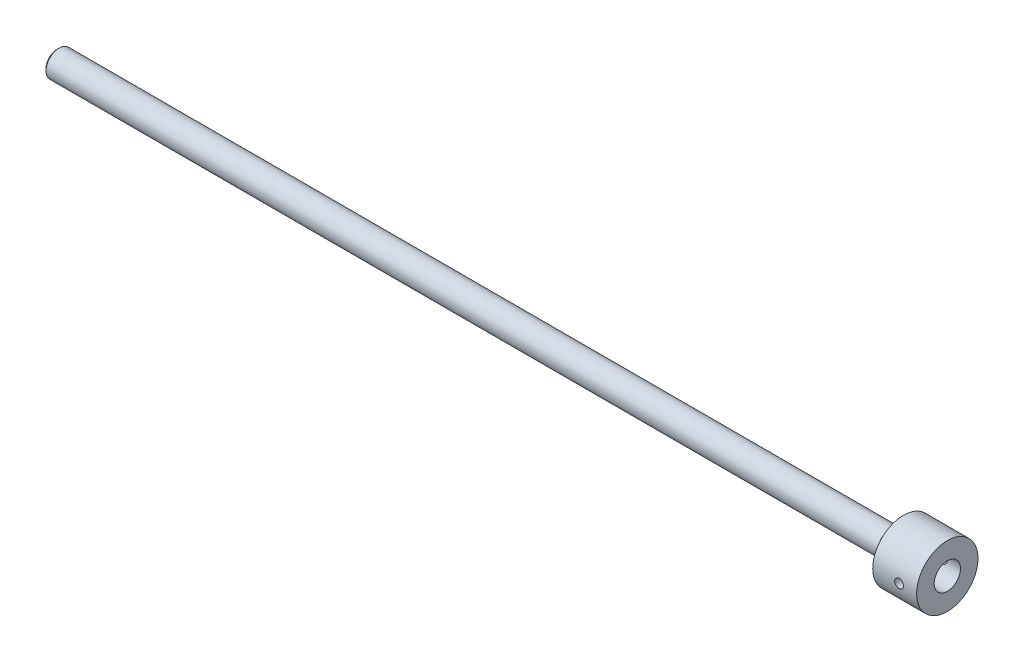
ISO-10303-21;
HEADER;
FILE_DESCRIPTION(('STEP AP214'),'2;1');
FILE_NAME('part.step','',(''),(''),'','','');
FILE_SCHEMA(('AUTOMOTIVE_DESIGN { 1 0 10303 214 1 1 1 1 }'));
ENDSEC;
DATA;
#1=APPLICATION_CONTEXT('core data for automotive mechanical design processes');
#2=APPLICATION_PROTOCOL_DEFINITION('international standard','automotive_design',2000,#1);
#3=PRODUCT_CONTEXT('',#1,'mechanical');
#4=PRODUCT('Part','Part','',(#3));
#5=PRODUCT_RELATED_PRODUCT_CATEGORY('part','',(#4));
#6=PRODUCT_DEFINITION_FORMATION('','',#4);
#7=PRODUCT_DEFINITION_CONTEXT('part definition',#1,'design');
#8=PRODUCT_DEFINITION('design','',#6,#7);
#9=PRODUCT_DEFINITION_SHAPE('','',#8);
#10=(LENGTH_UNIT() NAMED_UNIT(*) SI_UNIT(.MILLI.,.METRE.));
#11=(NAMED_UNIT(*) PLANE_ANGLE_UNIT() SI_UNIT($,.RADIAN.));
#12=(NAMED_UNIT(*) SI_UNIT($,.STERADIAN.) SOLID_ANGLE_UNIT());
#13=UNCERTAINTY_MEASURE_WITH_UNIT(LENGTH_MEASURE(1.E-05),#10,'distance_accuracy_value','');
#14=(GEOMETRIC_REPRESENTATION_CONTEXT(3) GLOBAL_UNCERTAINTY_ASSIGNED_CONTEXT((#13)) GLOBAL_UNIT_ASSIGNED_CONTEXT((#10,
#11,#12)) REPRESENTATION_CONTEXT('',''));
#15=CARTESIAN_POINT('',(0.,0.,0.));
#16=DIRECTION('',(0.,0.,1.));
#17=DIRECTION('',(1.,0.,0.));
#18=AXIS2_PLACEMENT_3D('',#15,#16,#17);
#19=CARTESIAN_POINT('',(0.,0.,0.));
#20=DIRECTION('',(-1.,0.,0.));
#21=DIRECTION('',(0.,0.,1.));
#22=AXIS2_PLACEMENT_3D('',#19,#20,#21);
#23=PLANE('',#22);
#24=CARTESIAN_POINT('',(0.,0.,0.));
#25=DIRECTION('',(1.,0.,0.));
#26=DIRECTION('',(0.,0.,-1.));
#27=AXIS2_PLACEMENT_3D('',#24,#25,#26);
#28=CIRCLE('',#27,3.);
#29=CARTESIAN_POINT('',(0.,0.,-3.00000000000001));
#30=VERTEX_POINT('',#29);
#31=EDGE_CURVE('E56',#30,#30,#28,.T.);
#32=ORIENTED_EDGE('',*,*,#31,.F.);
#33=EDGE_LOOP('',(#32));
#34=FACE_BOUND('',#33,.T.);
#35=CARTESIAN_POINT('',(0.,0.,0.));
#36=DIRECTION('',(-1.,0.,0.));
#37=DIRECTION('',(0.,0.,1.));
#38=AXIS2_PLACEMENT_3D('',#35,#36,#37);
#39=CIRCLE('',#38,7.);
#40=CARTESIAN_POINT('',(0.,0.,7.00000000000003));
#41=VERTEX_POINT('',#40);
#42=EDGE_CURVE('E83',#41,#41,#39,.T.);
#43=ORIENTED_EDGE('',*,*,#42,.F.);
#44=EDGE_LOOP('',(#43));
#45=FACE_BOUND('',#44,.T.);
#46=ADVANCED_FACE('F31',(#34,#45),#23,.F.);
#47=CARTESIAN_POINT('',(-202.86523063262,0.,0.));
#48=DIRECTION('',(-1.,0.,0.));
#49=DIRECTION('',(0.,0.,1.));
#50=AXIS2_PLACEMENT_3D('',#47,#48,#49);
#51=CYLINDRICAL_SURFACE('',#50,7.);
#52=CARTESIAN_POINT('',(-3.,0.,7.00000000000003));
#53=CARTESIAN_POINT('',(-3.00000232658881,-0.0558653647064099,6.99999913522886));
#54=CARTESIAN_POINT('',(-3.00469720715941,-0.111763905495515,6.99932420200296));
#55=CARTESIAN_POINT('',(-3.023349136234,-0.222000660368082,6.99669670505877));
#56=CARTESIAN_POINT('',(-3.03731540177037,-0.276337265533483,6.99474286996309));
#57=CARTESIAN_POINT('',(-3.07408606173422,-0.381838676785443,6.98977730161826));
#58=CARTESIAN_POINT('',(-3.09688399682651,-0.433005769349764,6.98676634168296));
#59=CARTESIAN_POINT('',(-3.15065554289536,-0.530779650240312,6.98001989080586));
#60=CARTESIAN_POINT('',(-3.18162793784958,-0.577387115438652,6.97628450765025));
#61=CARTESIAN_POINT('',(-3.25110417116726,-0.665058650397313,6.96847539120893));
#62=CARTESIAN_POINT('',(-3.28965464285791,-0.706085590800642,6.96439965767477));
#63=CARTESIAN_POINT('',(-3.37309241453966,-0.781111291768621,6.95638499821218));
#64=CARTESIAN_POINT('',(-3.41798006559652,-0.815109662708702,6.95244607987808));
#65=CARTESIAN_POINT('',(-3.51306511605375,-0.875255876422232,6.94513156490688));
#66=CARTESIAN_POINT('',(-3.56328524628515,-0.901368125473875,6.94175855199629));
#67=CARTESIAN_POINT('',(-3.66745453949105,-0.94477345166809,6.93598482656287));
#68=CARTESIAN_POINT('',(-3.72140351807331,-0.962066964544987,6.93358406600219));
#69=CARTESIAN_POINT('',(-3.83111000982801,-0.987229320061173,6.93004619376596));
#70=CARTESIAN_POINT('',(-3.88685271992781,-0.995161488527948,6.92890059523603));
#71=CARTESIAN_POINT('',(-3.99888890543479,-1.00157210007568,6.92797693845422));
#72=CARTESIAN_POINT('',(-4.05518235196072,-1.0000510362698,6.92819880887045));
#73=CARTESIAN_POINT('',(-4.16627654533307,-0.987650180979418,6.92997725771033));
#74=CARTESIAN_POINT('',(-4.22108532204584,-0.976840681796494,6.9315238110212));
#75=CARTESIAN_POINT('',(-4.32810308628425,-0.946279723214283,6.93576171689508));
#76=CARTESIAN_POINT('',(-4.38031200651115,-0.926528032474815,6.93845309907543));
#77=CARTESIAN_POINT('',(-4.48086327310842,-0.878569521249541,6.94468857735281));
#78=CARTESIAN_POINT('',(-4.52919111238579,-0.850332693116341,6.94823569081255));
#79=CARTESIAN_POINT('',(-4.6204492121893,-0.78622684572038,6.95578073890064));
#80=CARTESIAN_POINT('',(-4.66337915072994,-0.750357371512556,6.95977870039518));
#81=CARTESIAN_POINT('',(-4.74303040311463,-0.671617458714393,6.96781935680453));
#82=CARTESIAN_POINT('',(-4.77969194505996,-0.628686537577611,6.97186212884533));
#83=CARTESIAN_POINT('',(-4.84529850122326,-0.537249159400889,6.97950317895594));
#84=CARTESIAN_POINT('',(-4.87424348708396,-0.48874268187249,6.98310145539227));
#85=CARTESIAN_POINT('',(-4.92359743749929,-0.387481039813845,6.98945135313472));
#86=CARTESIAN_POINT('',(-4.94400205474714,-0.334723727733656,6.99220254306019));
#87=CARTESIAN_POINT('',(-4.97564546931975,-0.226483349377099,6.99654459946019));
#88=CARTESIAN_POINT('',(-4.9868848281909,-0.171000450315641,6.99813553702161));
#89=CARTESIAN_POINT('',(-4.99979981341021,-0.0594000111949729,6.99996847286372));
#90=CARTESIAN_POINT('',(-5.00155766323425,-0.00329216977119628,7.00022206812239));
#91=CARTESIAN_POINT('',(-4.99567759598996,0.108417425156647,6.9993832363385));
#92=CARTESIAN_POINT('',(-4.98803994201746,0.164019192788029,6.99829084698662));
#93=CARTESIAN_POINT('',(-4.96365402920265,0.272891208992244,6.99488996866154));
#94=CARTESIAN_POINT('',(-4.94694557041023,0.32617055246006,6.99258679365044));
#95=CARTESIAN_POINT('',(-4.9049341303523,0.429171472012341,6.98702187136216));
#96=CARTESIAN_POINT('',(-4.87963077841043,0.478892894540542,6.98376008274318));
#97=CARTESIAN_POINT('',(-4.82095309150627,0.573729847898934,6.9766118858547));
#98=CARTESIAN_POINT('',(-4.78752628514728,0.618812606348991,6.97272147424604));
#99=CARTESIAN_POINT('',(-4.71362396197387,0.702757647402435,6.96476223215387));
#100=CARTESIAN_POINT('',(-4.67314807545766,0.741619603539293,6.96069339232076));
#101=CARTESIAN_POINT('',(-4.58593164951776,0.812316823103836,6.95279940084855));
#102=CARTESIAN_POINT('',(-4.53914636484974,0.844097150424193,6.94897630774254));
#103=CARTESIAN_POINT('',(-4.44085340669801,0.899347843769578,6.94204235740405));
#104=CARTESIAN_POINT('',(-4.3893458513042,0.922818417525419,6.93893148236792));
#105=CARTESIAN_POINT('',(-4.28323834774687,0.960697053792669,6.93378885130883));
#106=CARTESIAN_POINT('',(-4.22864912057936,0.975134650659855,6.93175358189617));
#107=CARTESIAN_POINT('',(-4.11778971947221,0.994631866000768,6.92898304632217));
#108=CARTESIAN_POINT('',(-4.06151965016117,0.999692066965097,6.92824769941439));
#109=CARTESIAN_POINT('',(-3.94944308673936,1.00027795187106,6.92816308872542));
#110=CARTESIAN_POINT('',(-3.89363703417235,0.995889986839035,6.92880127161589));
#111=CARTESIAN_POINT('',(-3.78356493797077,0.977888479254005,6.9313646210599));
#112=CARTESIAN_POINT('',(-3.72929889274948,0.96427494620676,6.93328978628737));
#113=CARTESIAN_POINT('',(-3.62386736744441,0.928238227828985,6.93820594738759));
#114=CARTESIAN_POINT('',(-3.57269998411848,0.905820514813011,6.94119628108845));
#115=CARTESIAN_POINT('',(-3.4748387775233,0.85282032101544,6.94790672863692));
#116=CARTESIAN_POINT('',(-3.42814507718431,0.822237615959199,6.95162686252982));
#117=CARTESIAN_POINT('',(-3.34011709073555,0.753459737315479,6.95941831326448));
#118=CARTESIAN_POINT('',(-3.29883312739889,0.715200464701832,6.96349241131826));
#119=CARTESIAN_POINT('',(-3.22324014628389,0.632290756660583,6.97150911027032));
#120=CARTESIAN_POINT('',(-3.18893275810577,0.587638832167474,6.97545168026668));
#121=CARTESIAN_POINT('',(-3.12811621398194,0.492951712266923,6.98278331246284));
#122=CARTESIAN_POINT('',(-3.10164667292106,0.442890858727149,6.98616952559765));
#123=CARTESIAN_POINT('',(-3.05753012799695,0.339010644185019,6.99197878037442));
#124=CARTESIAN_POINT('',(-3.0398738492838,0.285195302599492,6.99440283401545));
#125=CARTESIAN_POINT('',(-3.01795820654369,0.192605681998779,6.99745181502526));
#126=CARTESIAN_POINT('',(-3.01123398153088,0.154406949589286,6.99840255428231));
#127=CARTESIAN_POINT('',(-3.0022540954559,0.0774774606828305,6.99967694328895));
#128=CARTESIAN_POINT('',(-2.99999838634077,0.0387467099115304,7.00000059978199));
#129=CARTESIAN_POINT('',(-3.,0.,7.00000000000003));
#130=B_SPLINE_CURVE_WITH_KNOTS('',3,(#52,#53,#54,#55,#56,#57,#58,#59,#60,#61,#62,#63,#64,#65,
#66,#67,#68,#69,#70,#71,#72,#73,#74,#75,#76,#77,#78,#79,#80,#81,#82,#83,#84,#85,#86,#87,#88,#89,
#90,#91,#92,#93,#94,#95,#96,#97,#98,#99,#100,#101,#102,#103,#104,#105,#106,#107,#108,#109,#110,
#111,#112,#113,#114,#115,#116,#117,#118,#119,#120,#121,#122,#123,#124,#125,#126,#127,#128,#129),
.UNSPECIFIED.,.T.,.F.,(4,2,2,2,2,2,2,2,2,2,2,2,2,2,2,2,2,2,2,2,2,2,2,2,2,2,2,2,2,2,2,2,2,2,2,2,
2,2,4),(0.,0.167454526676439,0.335075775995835,0.502574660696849,0.670048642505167,
0.838587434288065,1.00713556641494,1.17643344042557,1.34572294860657,1.51386059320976,
1.68198946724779,1.8488570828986,2.01572901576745,2.18319817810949,2.35067732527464,
2.51967378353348,2.6886708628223,2.85775386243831,3.02682650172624,3.19443056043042,
3.3620299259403,3.5288997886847,3.69577684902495,3.86376187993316,4.03175572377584,
4.20101062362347,4.37026129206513,4.53895564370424,4.70763951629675,4.87478825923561,
5.04193682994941,5.20898167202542,5.37603110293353,5.54453823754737,5.71308468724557,
5.88246902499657,6.05167472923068,6.16781792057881,6.28395986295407),.UNSPECIFIED.);
#131=CARTESIAN_POINT('',(-3.,0.,7.00000000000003));
#132=VERTEX_POINT('',#131);
#133=EDGE_CURVE('E57',#132,#132,#130,.T.);
#134=ORIENTED_EDGE('',*,*,#133,.T.);
#135=EDGE_LOOP('',(#134));
#136=FACE_BOUND('',#135,.T.);
#137=CARTESIAN_POINT('',(-3.,0.,-7.00000000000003));
#138=CARTESIAN_POINT('',(-3.00000232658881,0.0558653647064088,-6.99999913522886));
#139=CARTESIAN_POINT('',(-3.00469720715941,0.111763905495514,-6.99932420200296));
#140=CARTESIAN_POINT('',(-3.02334913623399,0.22200066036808,-6.99669670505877));
#141=CARTESIAN_POINT('',(-3.03731540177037,0.276337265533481,-6.9947428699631));
#142=CARTESIAN_POINT('',(-3.07408606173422,0.381838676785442,-6.98977730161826));
#143=CARTESIAN_POINT('',(-3.0968839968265,0.433005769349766,-6.98676634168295));
#144=CARTESIAN_POINT('',(-3.15065554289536,0.530779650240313,-6.98001989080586));
#145=CARTESIAN_POINT('',(-3.18162793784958,0.577387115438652,-6.97628450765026));
#146=CARTESIAN_POINT('',(-3.25110417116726,0.665058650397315,-6.96847539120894));
#147=CARTESIAN_POINT('',(-3.28965464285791,0.706085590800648,-6.96439965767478));
#148=CARTESIAN_POINT('',(-3.37309241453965,0.781111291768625,-6.95638499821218));
#149=CARTESIAN_POINT('',(-3.41798006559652,0.815109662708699,-6.95244607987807));
#150=CARTESIAN_POINT('',(-3.51306511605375,0.875255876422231,-6.94513156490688));
#151=CARTESIAN_POINT('',(-3.56328524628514,0.901368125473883,-6.94175855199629));
#152=CARTESIAN_POINT('',(-3.66745453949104,0.944773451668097,-6.93598482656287));
#153=CARTESIAN_POINT('',(-3.72140351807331,0.962066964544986,-6.93358406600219));
#154=CARTESIAN_POINT('',(-3.83111000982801,0.987229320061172,-6.93004619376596));
#155=CARTESIAN_POINT('',(-3.88685271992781,0.995161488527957,-6.92890059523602));
#156=CARTESIAN_POINT('',(-3.99888890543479,1.00157210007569,-6.92797693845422));
#157=CARTESIAN_POINT('',(-4.05518235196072,1.0000510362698,-6.92819880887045));
#158=CARTESIAN_POINT('',(-4.16627654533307,0.987650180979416,-6.92997725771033));
#159=CARTESIAN_POINT('',(-4.22108532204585,0.976840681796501,-6.93152381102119));
#160=CARTESIAN_POINT('',(-4.32810308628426,0.946279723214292,-6.93576171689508));
#161=CARTESIAN_POINT('',(-4.38031200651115,0.926528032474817,-6.93845309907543));
#162=CARTESIAN_POINT('',(-4.48086327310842,0.878569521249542,-6.94468857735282));
#163=CARTESIAN_POINT('',(-4.5291911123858,0.850332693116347,-6.94823569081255));
#164=CARTESIAN_POINT('',(-4.6204492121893,0.786226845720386,-6.95578073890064));
#165=CARTESIAN_POINT('',(-4.66337915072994,0.750357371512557,-6.95977870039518));
#166=CARTESIAN_POINT('',(-4.74303040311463,0.671617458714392,-6.96781935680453));
#167=CARTESIAN_POINT('',(-4.77969194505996,0.628686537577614,-6.97186212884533));
#168=CARTESIAN_POINT('',(-4.84529850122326,0.537249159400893,-6.97950317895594));
#169=CARTESIAN_POINT('',(-4.87424348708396,0.488742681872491,-6.98310145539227));
#170=CARTESIAN_POINT('',(-4.92359743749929,0.387481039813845,-6.98945135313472));
#171=CARTESIAN_POINT('',(-4.94400205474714,0.334723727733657,-6.99220254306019));
#172=CARTESIAN_POINT('',(-4.97564546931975,0.2264833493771,-6.99654459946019));
#173=CARTESIAN_POINT('',(-4.9868848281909,0.171000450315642,-6.9981355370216));
#174=CARTESIAN_POINT('',(-4.99979981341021,0.0594000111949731,-6.99996847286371));
#175=CARTESIAN_POINT('',(-5.00155766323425,0.00329216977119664,-7.00022206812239));
#176=CARTESIAN_POINT('',(-4.99567759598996,-0.108417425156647,-6.9993832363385));
#177=CARTESIAN_POINT('',(-4.98803994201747,-0.16401919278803,-6.99829084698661));
#178=CARTESIAN_POINT('',(-4.96365402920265,-0.272891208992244,-6.99488996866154));
#179=CARTESIAN_POINT('',(-4.94694557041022,-0.32617055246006,-6.99258679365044));
#180=CARTESIAN_POINT('',(-4.90493413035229,-0.429171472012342,-6.98702187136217));
#181=CARTESIAN_POINT('',(-4.87963077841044,-0.478892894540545,-6.98376008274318));
#182=CARTESIAN_POINT('',(-4.82095309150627,-0.573729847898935,-6.97661188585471));
#183=CARTESIAN_POINT('',(-4.78752628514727,-0.618812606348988,-6.97272147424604));
#184=CARTESIAN_POINT('',(-4.71362396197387,-0.702757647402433,-6.96476223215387));
#185=CARTESIAN_POINT('',(-4.67314807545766,-0.741619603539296,-6.96069339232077));
#186=CARTESIAN_POINT('',(-4.58593164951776,-0.812316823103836,-6.95279940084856));
#187=CARTESIAN_POINT('',(-4.53914636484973,-0.844097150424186,-6.94897630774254));
#188=CARTESIAN_POINT('',(-4.44085340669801,-0.899347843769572,-6.94204235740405));
#189=CARTESIAN_POINT('',(-4.3893458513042,-0.92281841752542,-6.93893148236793));
#190=CARTESIAN_POINT('',(-4.28323834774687,-0.960697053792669,-6.93378885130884));
#191=CARTESIAN_POINT('',(-4.22864912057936,-0.975134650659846,-6.93175358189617));
#192=CARTESIAN_POINT('',(-4.11778971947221,-0.99463186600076,-6.92898304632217));
#193=CARTESIAN_POINT('',(-4.06151965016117,-0.999692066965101,-6.92824769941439));
#194=CARTESIAN_POINT('',(-3.94944308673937,-1.00027795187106,-6.92816308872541));
#195=CARTESIAN_POINT('',(-3.89363703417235,-0.995889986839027,-6.92880127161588));
#196=CARTESIAN_POINT('',(-3.78356493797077,-0.977888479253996,-6.9313646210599));
#197=CARTESIAN_POINT('',(-3.72929889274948,-0.96427494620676,-6.93328978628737));
#198=CARTESIAN_POINT('',(-3.62386736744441,-0.928238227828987,-6.9382059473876));
#199=CARTESIAN_POINT('',(-3.57269998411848,-0.905820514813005,-6.94119628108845));
#200=CARTESIAN_POINT('',(-3.4748387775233,-0.852820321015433,-6.94790672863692));
#201=CARTESIAN_POINT('',(-3.42814507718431,-0.822237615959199,-6.95162686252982));
#202=CARTESIAN_POINT('',(-3.34011709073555,-0.753459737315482,-6.95941831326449));
#203=CARTESIAN_POINT('',(-3.29883312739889,-0.715200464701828,-6.96349241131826));
#204=CARTESIAN_POINT('',(-3.22324014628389,-0.632290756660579,-6.97150911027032));
#205=CARTESIAN_POINT('',(-3.18893275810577,-0.587638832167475,-6.97545168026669));
#206=CARTESIAN_POINT('',(-3.12811621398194,-0.492951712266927,-6.98278331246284));
#207=CARTESIAN_POINT('',(-3.10164667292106,-0.44289085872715,-6.98616952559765));
#208=CARTESIAN_POINT('',(-3.05753012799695,-0.339010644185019,-6.99197878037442));
#209=CARTESIAN_POINT('',(-3.0398738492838,-0.285195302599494,-6.99440283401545));
#210=CARTESIAN_POINT('',(-3.01795820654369,-0.192605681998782,-6.99745181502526));
#211=CARTESIAN_POINT('',(-3.01123398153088,-0.154406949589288,-6.99840255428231));
#212=CARTESIAN_POINT('',(-3.0022540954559,-0.0774774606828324,-6.99967694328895));
#213=CARTESIAN_POINT('',(-2.99999838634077,-0.0387467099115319,-7.00000059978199));
#214=CARTESIAN_POINT('',(-3.,0.,-7.00000000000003));
#215=B_SPLINE_CURVE_WITH_KNOTS('',3,(#137,#138,#139,#140,#141,#142,#143,#144,#145,#146,#147,
#148,#149,#150,#151,#152,#153,#154,#155,#156,#157,#158,#159,#160,#161,#162,#163,#164,#165,#166,
#167,#168,#169,#170,#171,#172,#173,#174,#175,#176,#177,#178,#179,#180,#181,#182,#183,#184,#185,
#186,#187,#188,#189,#190,#191,#192,#193,#194,#195,#196,#197,#198,#199,#200,#201,#202,#203,#204,
#205,#206,#207,#208,#209,#210,#211,#212,#213,#214),.UNSPECIFIED.,.T.,.F.,(4,2,2,2,2,2,2,2,2,2,2,
2,2,2,2,2,2,2,2,2,2,2,2,2,2,2,2,2,2,2,2,2,2,2,2,2,2,2,4),(0.,0.167454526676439,
0.335075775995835,0.50257466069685,0.67004864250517,0.838587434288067,1.00713556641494,
1.17643344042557,1.34572294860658,1.51386059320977,1.6819894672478,1.84885708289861,
2.01572901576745,2.1831981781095,2.35067732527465,2.51967378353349,2.68867086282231,
2.85775386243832,3.02682650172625,3.19443056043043,3.36202992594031,3.52889978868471,
3.69577684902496,3.86376187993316,4.03175572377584,4.20101062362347,4.37026129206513,
4.53895564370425,4.70763951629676,4.87478825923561,5.04193682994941,5.20898167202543,
5.37603110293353,5.54453823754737,5.71308468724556,5.88246902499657,6.05167472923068,
6.16781792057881,6.28395986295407),.UNSPECIFIED.);
#216=CARTESIAN_POINT('',(-3.,0.,-7.00000000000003));
#217=VERTEX_POINT('',#216);
#218=EDGE_CURVE('E63',#217,#217,#215,.T.);
#219=ORIENTED_EDGE('',*,*,#218,.T.);
#220=EDGE_LOOP('',(#219));
#221=FACE_BOUND('',#220,.T.);
#222=CARTESIAN_POINT('',(-10.,0.,0.));
#223=DIRECTION('',(-1.,0.,0.));
#224=DIRECTION('',(0.,0.,1.));
#225=AXIS2_PLACEMENT_3D('',#222,#223,#224);
#226=CIRCLE('',#225,7.);
#227=CARTESIAN_POINT('',(-10.,0.,7.00000000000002));
#228=VERTEX_POINT('',#227);
#229=EDGE_CURVE('E80',#228,#228,#226,.T.);
#230=ORIENTED_EDGE('',*,*,#229,.F.);
#231=EDGE_LOOP('',(#230));
#232=FACE_BOUND('',#231,.T.);
#233=ORIENTED_EDGE('',*,*,#42,.T.);
#234=EDGE_LOOP('',(#233));
#235=FACE_BOUND('',#234,.T.);
#236=ADVANCED_FACE('F103',(#136,#221,#232,#235),#51,.T.);
#237=CARTESIAN_POINT('',(-10.,0.,0.));
#238=DIRECTION('',(1.,0.,0.));
#239=DIRECTION('',(0.,0.,-1.));
#240=AXIS2_PLACEMENT_3D('',#237,#238,#239);
#241=CONICAL_SURFACE('',#240,7.,1.13446401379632);
#242=CARTESIAN_POINT('',(-11.86523063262,0.,0.));
#243=DIRECTION('',(-1.,0.,0.));
#244=DIRECTION('',(0.,0.,1.));
#245=AXIS2_PLACEMENT_3D('',#242,#243,#244);
#246=CIRCLE('',#245,3.);
#247=CARTESIAN_POINT('',(-11.86523063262,0.,3.00000000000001));
#248=VERTEX_POINT('',#247);
#249=EDGE_CURVE('E77',#248,#248,#246,.T.);
#250=ORIENTED_EDGE('',*,*,#249,.F.);
#251=EDGE_LOOP('',(#250));
#252=FACE_BOUND('',#251,.T.);
#253=ORIENTED_EDGE('',*,*,#229,.T.);
#254=EDGE_LOOP('',(#253));
#255=FACE_BOUND('',#254,.T.);
#256=ADVANCED_FACE('F107',(#252,#255),#241,.T.);
#257=CARTESIAN_POINT('',(-11.86523063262,3.00000000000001,0.));
#258=DIRECTION('',(1.,0.,0.));
#259=DIRECTION('',(0.,0.,-1.));
#260=AXIS2_PLACEMENT_3D('',#257,#258,#259);
#261=PLANE('',#260);
#262=CARTESIAN_POINT('',(-11.86523063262,0.,0.));
#263=DIRECTION('',(-1.,0.,0.));
#264=DIRECTION('',(0.,0.,1.));
#265=AXIS2_PLACEMENT_3D('',#262,#263,#264);
#266=CIRCLE('',#265,2.5);
#267=CARTESIAN_POINT('',(-11.86523063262,0.,2.50000000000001));
#268=VERTEX_POINT('',#267);
#269=EDGE_CURVE('E74',#268,#268,#266,.T.);
#270=ORIENTED_EDGE('',*,*,#269,.F.);
#271=EDGE_LOOP('',(#270));
#272=FACE_BOUND('',#271,.T.);
#273=ORIENTED_EDGE('',*,*,#249,.T.);
#274=EDGE_LOOP('',(#273));
#275=FACE_BOUND('',#274,.T.);
#276=ADVANCED_FACE('F112',(#272,#275),#261,.F.);
#277=CARTESIAN_POINT('',(-202.86523063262,0.,0.));
#278=DIRECTION('',(-1.,0.,0.));
#279=DIRECTION('',(0.,0.,1.));
#280=AXIS2_PLACEMENT_3D('',#277,#278,#279);
#281=CYLINDRICAL_SURFACE('',#280,2.5);
#282=CARTESIAN_POINT('',(-12.86523063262,0.,0.));
#283=DIRECTION('',(-1.,0.,0.));
#284=DIRECTION('',(0.,0.,1.));
#285=AXIS2_PLACEMENT_3D('',#282,#283,#284);
#286=CIRCLE('',#285,2.5);
#287=CARTESIAN_POINT('',(-12.86523063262,0.,2.50000000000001));
#288=VERTEX_POINT('',#287);
#289=EDGE_CURVE('E71',#288,#288,#286,.T.);
#290=ORIENTED_EDGE('',*,*,#289,.F.);
#291=EDGE_LOOP('',(#290));
#292=FACE_BOUND('',#291,.T.);
#293=ORIENTED_EDGE('',*,*,#269,.T.);
#294=EDGE_LOOP('',(#293));
#295=FACE_BOUND('',#294,.T.);
#296=ADVANCED_FACE('F116',(#292,#295),#281,.T.);
#297=CARTESIAN_POINT('',(-12.86523063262,2.50000000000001,0.));
#298=DIRECTION('',(-1.,0.,0.));
#299=DIRECTION('',(0.,0.,1.));
#300=AXIS2_PLACEMENT_3D('',#297,#298,#299);
#301=PLANE('',#300);
#302=CARTESIAN_POINT('',(-12.86523063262,0.,0.));
#303=DIRECTION('',(-1.,0.,0.));
#304=DIRECTION('',(0.,0.,1.));
#305=AXIS2_PLACEMENT_3D('',#302,#303,#304);
#306=CIRCLE('',#305,3.);
#307=CARTESIAN_POINT('',(-12.86523063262,0.,3.00000000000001));
#308=VERTEX_POINT('',#307);
#309=EDGE_CURVE('E60',#308,#308,#306,.T.);
#310=ORIENTED_EDGE('',*,*,#309,.F.);
#311=EDGE_LOOP('',(#310));
#312=FACE_BOUND('',#311,.T.);
#313=ORIENTED_EDGE('',*,*,#289,.T.);
#314=EDGE_LOOP('',(#313));
#315=FACE_BOUND('',#314,.T.);
#316=ADVANCED_FACE('F120',(#312,#315),#301,.F.);
#317=CARTESIAN_POINT('',(-202.86523063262,0.,0.));
#318=DIRECTION('',(-1.,0.,0.));
#319=DIRECTION('',(0.,0.,1.));
#320=AXIS2_PLACEMENT_3D('',#317,#318,#319);
#321=CYLINDRICAL_SURFACE('',#320,2.99999999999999);
#322=CARTESIAN_POINT('',(-202.36523063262,0.,0.));
#323=DIRECTION('',(1.,0.,0.));
#324=DIRECTION('',(0.,0.,-1.));
#325=AXIS2_PLACEMENT_3D('',#322,#323,#324);
#326=CIRCLE('',#325,2.99999999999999);
#327=CARTESIAN_POINT('',(-202.36523063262,0.,-3.));
#328=VERTEX_POINT('',#327);
#329=EDGE_CURVE('E11',#328,#328,#326,.T.);
#330=ORIENTED_EDGE('',*,*,#329,.T.);
#331=EDGE_LOOP('',(#330));
#332=FACE_BOUND('',#331,.T.);
#333=ORIENTED_EDGE('',*,*,#309,.T.);
#334=EDGE_LOOP('',(#333));
#335=FACE_BOUND('',#334,.T.);
#336=ADVANCED_FACE('F124',(#332,#335),#321,.T.);
#337=CARTESIAN_POINT('',(-202.86523063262,2.99999999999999,0.));
#338=DIRECTION('',(1.,0.,0.));
#339=DIRECTION('',(0.,0.,-1.));
#340=AXIS2_PLACEMENT_3D('',#337,#338,#339);
#341=PLANE('',#340);
#342=CARTESIAN_POINT('',(-202.86523063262,0.,0.));
#343=DIRECTION('',(1.,0.,0.));
#344=DIRECTION('',(0.,0.,-1.));
#345=AXIS2_PLACEMENT_3D('',#342,#343,#344);
#346=CIRCLE('',#345,2.49999999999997);
#347=CARTESIAN_POINT('',(-202.86523063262,0.,-2.49999999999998));
#348=VERTEX_POINT('',#347);
#349=EDGE_CURVE('E42',#348,#348,#346,.F.);
#350=ORIENTED_EDGE('',*,*,#349,.T.);
#351=EDGE_LOOP('',(#350));
#352=FACE_BOUND('',#351,.T.);
#353=ADVANCED_FACE('F128',(#352),#341,.F.);
#354=CARTESIAN_POINT('',(-202.86523063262,0.,0.));
#355=DIRECTION('',(1.,0.,0.));
#356=DIRECTION('',(0.,0.,-1.));
#357=AXIS2_PLACEMENT_3D('',#354,#355,#356);
#358=CONICAL_SURFACE('',#357,2.49999999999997,0.785398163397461);
#359=ORIENTED_EDGE('',*,*,#329,.F.);
#360=EDGE_LOOP('',(#359));
#361=FACE_BOUND('',#360,.T.);
#362=ORIENTED_EDGE('',*,*,#349,.F.);
#363=EDGE_LOOP('',(#362));
#364=FACE_BOUND('',#363,.T.);
#365=ADVANCED_FACE('F131',(#361,#364),#358,.T.);
#366=CARTESIAN_POINT('',(0.,0.,0.));
#367=DIRECTION('',(1.,0.,0.));
#368=DIRECTION('',(0.,0.,-1.));
#369=AXIS2_PLACEMENT_3D('',#366,#367,#368);
#370=CYLINDRICAL_SURFACE('',#369,3.);
#371=CARTESIAN_POINT('',(-5.,0.,-3.00000000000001));
#372=CARTESIAN_POINT('',(-5.00000025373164,0.0545633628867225,-3.00000015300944));
#373=CARTESIAN_POINT('',(-4.99551973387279,0.109125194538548,-2.99849769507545));
#374=CARTESIAN_POINT('',(-4.97777089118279,0.216641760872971,-2.99265210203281));
#375=CARTESIAN_POINT('',(-4.96450165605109,0.269596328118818,-2.98830867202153));
#376=CARTESIAN_POINT('',(-4.92968075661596,0.372332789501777,-2.97725307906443));
#377=CARTESIAN_POINT('',(-4.90814293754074,0.422119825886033,-2.97054487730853));
#378=CARTESIAN_POINT('',(-4.85745882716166,0.517374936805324,-2.95544445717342));
#379=CARTESIAN_POINT('',(-4.8283110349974,0.562842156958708,-2.94705190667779));
#380=CARTESIAN_POINT('',(-4.76217419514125,0.649741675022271,-2.92914094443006));
#381=CARTESIAN_POINT('',(-4.72496876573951,0.691003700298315,-2.91959556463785));
#382=CARTESIAN_POINT('',(-4.64423284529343,0.766832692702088,-2.90060314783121));
#383=CARTESIAN_POINT('',(-4.60070096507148,0.801398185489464,-2.8911561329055));
#384=CARTESIAN_POINT('',(-4.50701488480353,0.863824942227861,-2.87313332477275));
#385=CARTESIAN_POINT('',(-4.45670626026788,0.891464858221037,-2.86459039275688));
#386=CARTESIAN_POINT('',(-4.35182390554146,0.937818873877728,-2.84975305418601));
#387=CARTESIAN_POINT('',(-4.29725148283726,0.95653569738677,-2.84345796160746));
#388=CARTESIAN_POINT('',(-4.18732677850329,0.983873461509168,-2.83411303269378));
#389=CARTESIAN_POINT('',(-4.13206279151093,0.992813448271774,-2.83096095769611));
#390=CARTESIAN_POINT('',(-4.02073624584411,1.00134112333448,-2.82795656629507));
#391=CARTESIAN_POINT('',(-3.9646739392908,1.00093170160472,-2.82810323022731));
#392=CARTESIAN_POINT('',(-3.85606336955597,0.99101990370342,-2.83159015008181));
#393=CARTESIAN_POINT('',(-3.80347159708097,0.981933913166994,-2.83478415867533));
#394=CARTESIAN_POINT('',(-3.70060658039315,0.955606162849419,-2.84376657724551));
#395=CARTESIAN_POINT('',(-3.65033361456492,0.938363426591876,-2.84955529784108));
#396=CARTESIAN_POINT('',(-3.55258725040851,0.895939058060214,-2.86317911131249));
#397=CARTESIAN_POINT('',(-3.50517197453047,0.87063404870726,-2.87104565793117));
#398=CARTESIAN_POINT('',(-3.41512909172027,0.812889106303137,-2.88792558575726));
#399=CARTESIAN_POINT('',(-3.37250287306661,0.780447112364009,-2.89693929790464));
#400=CARTESIAN_POINT('',(-3.29090840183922,0.70734933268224,-2.91567329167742));
#401=CARTESIAN_POINT('',(-3.25224730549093,0.666353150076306,-2.92540589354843));
#402=CARTESIAN_POINT('',(-3.1822687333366,0.578339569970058,-2.94406938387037));
#403=CARTESIAN_POINT('',(-3.15095196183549,0.531321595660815,-2.95300019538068));
#404=CARTESIAN_POINT('',(-3.09630369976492,0.431947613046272,-2.96917107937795));
#405=CARTESIAN_POINT('',(-3.07305450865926,0.379543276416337,-2.97639350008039));
#406=CARTESIAN_POINT('',(-3.0357968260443,0.271269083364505,-2.98820567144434));
#407=CARTESIAN_POINT('',(-3.02178512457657,0.215400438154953,-2.99279633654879));
#408=CARTESIAN_POINT('',(-3.00394433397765,0.104383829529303,-2.99867627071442));
#409=CARTESIAN_POINT('',(-2.99970019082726,0.0493095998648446,-3.00010001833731));
#410=CARTESIAN_POINT('',(-3.00033267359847,-0.0607750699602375,-2.99988902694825));
#411=CARTESIAN_POINT('',(-3.00520775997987,-0.115785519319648,-2.99825480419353));
#412=CARTESIAN_POINT('',(-3.02361190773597,-0.22251986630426,-2.99220024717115));
#413=CARTESIAN_POINT('',(-3.03688620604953,-0.274292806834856,-2.98786198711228));
#414=CARTESIAN_POINT('',(-3.07139344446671,-0.374855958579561,-2.97691846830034));
#415=CARTESIAN_POINT('',(-3.09262739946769,-0.423645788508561,-2.97031292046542));
#416=CARTESIAN_POINT('',(-3.14307043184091,-0.518288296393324,-2.95528931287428));
#417=CARTESIAN_POINT('',(-3.17247459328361,-0.564029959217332,-2.94682814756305));
#418=CARTESIAN_POINT('',(-3.23819415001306,-0.650064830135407,-2.92905253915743));
#419=CARTESIAN_POINT('',(-3.27451165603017,-0.690356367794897,-2.91973783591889));
#420=CARTESIAN_POINT('',(-3.35497875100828,-0.766252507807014,-2.90076847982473));
#421=CARTESIAN_POINT('',(-3.39940922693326,-0.801560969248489,-2.89111761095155));
#422=CARTESIAN_POINT('',(-3.49377156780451,-0.864257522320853,-2.87299973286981));
#423=CARTESIAN_POINT('',(-3.54370347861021,-0.891645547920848,-2.86453273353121));
#424=CARTESIAN_POINT('',(-3.6476730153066,-0.937596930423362,-2.84982391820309));
#425=CARTESIAN_POINT('',(-3.70170207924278,-0.95617813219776,-2.84357760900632));
#426=CARTESIAN_POINT('',(-3.81237865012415,-0.983894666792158,-2.83410832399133));
#427=CARTESIAN_POINT('',(-3.86902496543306,-0.993034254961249,-2.83088398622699));
#428=CARTESIAN_POINT('',(-3.9801970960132,-1.00127628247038,-2.82797858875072));
#429=CARTESIAN_POINT('',(-4.03468234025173,-1.00087025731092,-2.82812400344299));
#430=CARTESIAN_POINT('',(-4.14276507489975,-0.991242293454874,-2.8315126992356));
#431=CARTESIAN_POINT('',(-4.19636261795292,-0.982020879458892,-2.83475579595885));
#432=CARTESIAN_POINT('',(-4.30013566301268,-0.955371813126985,-2.84384524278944));
#433=CARTESIAN_POINT('',(-4.35035682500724,-0.938103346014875,-2.84964098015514));
#434=CARTESIAN_POINT('',(-4.44722740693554,-0.895979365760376,-2.86316398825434));
#435=CARTESIAN_POINT('',(-4.49387603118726,-0.87112216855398,-2.87089168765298));
#436=CARTESIAN_POINT('',(-4.58448366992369,-0.813260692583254,-2.88782829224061));
#437=CARTESIAN_POINT('',(-4.6282365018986,-0.779948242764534,-2.89708711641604));
#438=CARTESIAN_POINT('',(-4.70968981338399,-0.706642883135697,-2.91583356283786));
#439=CARTESIAN_POINT('',(-4.74738857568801,-0.666648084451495,-2.92532124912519));
#440=CARTESIAN_POINT('',(-4.81714441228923,-0.579241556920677,-2.94390030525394));
#441=CARTESIAN_POINT('',(-4.84892434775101,-0.53160151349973,-2.95296181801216));
#442=CARTESIAN_POINT('',(-4.90399042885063,-0.431357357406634,-2.96925991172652));
#443=CARTESIAN_POINT('',(-4.92727874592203,-0.378754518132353,-2.97649695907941));
#444=CARTESIAN_POINT('',(-4.96372163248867,-0.272493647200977,-2.98805515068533));
#445=CARTESIAN_POINT('',(-4.97728246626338,-0.218987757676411,-2.9924921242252));
#446=CARTESIAN_POINT('',(-4.99542028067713,-0.110320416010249,-2.99846407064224));
#447=CARTESIAN_POINT('',(-4.99999974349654,-0.0551594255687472,-2.99999984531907));
#448=CARTESIAN_POINT('',(-5.,0.,-3.00000000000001));
#449=B_SPLINE_CURVE_WITH_KNOTS('',3,(#371,#372,#373,#374,#375,#376,#377,#378,#379,#380,#381,
#382,#383,#384,#385,#386,#387,#388,#389,#390,#391,#392,#393,#394,#395,#396,#397,#398,#399,#400,
#401,#402,#403,#404,#405,#406,#407,#408,#409,#410,#411,#412,#413,#414,#415,#416,#417,#418,#419,
#420,#421,#422,#423,#424,#425,#426,#427,#428,#429,#430,#431,#432,#433,#434,#435,#436,#437,#438,
#439,#440,#441,#442,#443,#444,#445,#446,#447,#448),.UNSPECIFIED.,.T.,.F.,(4,2,2,2,2,2,2,2,2,2,2,
2,2,2,2,2,2,2,2,2,2,2,2,2,2,2,2,2,2,2,2,2,2,2,2,2,2,2,4),(0.,0.16348710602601,0.326991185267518,
0.490222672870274,0.653486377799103,0.821846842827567,0.990244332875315,1.16348384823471,
1.33667044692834,1.50401925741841,1.67131633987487,1.83096826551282,1.99063930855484,
2.15288171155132,2.31517102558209,2.48593305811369,2.6567114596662,2.82918405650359,
3.00159668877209,3.16653583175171,3.33144713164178,3.49158157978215,3.65173645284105,
3.81610399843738,3.98052180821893,4.15241022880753,4.32430008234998,4.49584013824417,
4.66730284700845,4.82995666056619,4.99260079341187,5.15215587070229,5.31174638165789,
5.47830066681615,5.64490211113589,5.81799660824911,5.99104681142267,6.15636558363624,
6.32163866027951),.UNSPECIFIED.);
#450=CARTESIAN_POINT('',(-5.,0.,-3.00000000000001));
#451=VERTEX_POINT('',#450);
#452=EDGE_CURVE('E34',#451,#451,#449,.T.);
#453=ORIENTED_EDGE('',*,*,#452,.T.);
#454=EDGE_LOOP('',(#453));
#455=FACE_BOUND('',#454,.T.);
#456=CARTESIAN_POINT('',(-3.,0.,3.00000000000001));
#457=CARTESIAN_POINT('',(-2.99999974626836,0.0545633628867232,3.00000015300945));
#458=CARTESIAN_POINT('',(-3.00448026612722,0.109125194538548,2.99849769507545));
#459=CARTESIAN_POINT('',(-3.02222910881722,0.216641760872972,2.99265210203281));
#460=CARTESIAN_POINT('',(-3.03549834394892,0.269596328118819,2.98830867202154));
#461=CARTESIAN_POINT('',(-3.07031924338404,0.372332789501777,2.97725307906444));
#462=CARTESIAN_POINT('',(-3.09185706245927,0.422119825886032,2.97054487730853));
#463=CARTESIAN_POINT('',(-3.14254117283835,0.517374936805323,2.95544445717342));
#464=CARTESIAN_POINT('',(-3.1716889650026,0.562842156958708,2.94705190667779));
#465=CARTESIAN_POINT('',(-3.23782580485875,0.649741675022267,2.92914094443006));
#466=CARTESIAN_POINT('',(-3.27503123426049,0.691003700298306,2.91959556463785));
#467=CARTESIAN_POINT('',(-3.35576715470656,0.766832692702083,2.90060314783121));
#468=CARTESIAN_POINT('',(-3.3992990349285,0.801398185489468,2.8911561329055));
#469=CARTESIAN_POINT('',(-3.49298511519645,0.863824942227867,2.87313332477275));
#470=CARTESIAN_POINT('',(-3.54329373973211,0.891464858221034,2.86459039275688));
#471=CARTESIAN_POINT('',(-3.64817609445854,0.937818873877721,2.84975305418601));
#472=CARTESIAN_POINT('',(-3.70274851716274,0.956535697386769,2.84345796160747));
#473=CARTESIAN_POINT('',(-3.81267322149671,0.98387346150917,2.83411303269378));
#474=CARTESIAN_POINT('',(-3.86793720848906,0.992813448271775,2.83096095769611));
#475=CARTESIAN_POINT('',(-3.97926375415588,1.00134112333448,2.82795656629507));
#476=CARTESIAN_POINT('',(-4.03532606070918,1.00093170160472,2.82810323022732));
#477=CARTESIAN_POINT('',(-4.14393663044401,0.991019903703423,2.83159015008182));
#478=CARTESIAN_POINT('',(-4.19652840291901,0.981933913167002,2.83478415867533));
#479=CARTESIAN_POINT('',(-4.29939341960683,0.955606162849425,2.8437665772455));
#480=CARTESIAN_POINT('',(-4.34966638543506,0.938363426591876,2.84955529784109));
#481=CARTESIAN_POINT('',(-4.44741274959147,0.895939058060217,2.8631791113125));
#482=CARTESIAN_POINT('',(-4.49482802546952,0.870634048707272,2.87104565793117));
#483=CARTESIAN_POINT('',(-4.58487090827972,0.812889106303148,2.88792558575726));
#484=CARTESIAN_POINT('',(-4.62749712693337,0.780447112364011,2.89693929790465));
#485=CARTESIAN_POINT('',(-4.70909159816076,0.707349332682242,2.91567329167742));
#486=CARTESIAN_POINT('',(-4.74775269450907,0.66635315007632,2.92540589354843));
#487=CARTESIAN_POINT('',(-4.8177312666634,0.578339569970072,2.94406938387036));
#488=CARTESIAN_POINT('',(-4.84904803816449,0.531321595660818,2.95300019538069));
#489=CARTESIAN_POINT('',(-4.90369630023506,0.431947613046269,2.96917107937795));
#490=CARTESIAN_POINT('',(-4.92694549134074,0.379543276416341,2.97639350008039));
#491=CARTESIAN_POINT('',(-4.96420317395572,0.271269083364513,2.98820567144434));
#492=CARTESIAN_POINT('',(-4.97821487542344,0.215400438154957,2.9927963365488));
#493=CARTESIAN_POINT('',(-4.99605566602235,0.104383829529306,2.99867627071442));
#494=CARTESIAN_POINT('',(-5.00029980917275,0.0493095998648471,3.00010001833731));
#495=CARTESIAN_POINT('',(-4.99966732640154,-0.0607750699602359,2.99988902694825));
#496=CARTESIAN_POINT('',(-4.99479224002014,-0.115785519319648,2.99825480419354));
#497=CARTESIAN_POINT('',(-4.97638809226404,-0.22251986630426,2.99220024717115));
#498=CARTESIAN_POINT('',(-4.96311379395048,-0.274292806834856,2.98786198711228));
#499=CARTESIAN_POINT('',(-4.9286065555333,-0.374855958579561,2.97691846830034));
#500=CARTESIAN_POINT('',(-4.90737260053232,-0.423645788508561,2.97031292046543));
#501=CARTESIAN_POINT('',(-4.8569295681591,-0.518288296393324,2.95528931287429));
#502=CARTESIAN_POINT('',(-4.8275254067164,-0.564029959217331,2.94682814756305));
#503=CARTESIAN_POINT('',(-4.76180584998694,-0.650064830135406,2.92905253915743));
#504=CARTESIAN_POINT('',(-4.72548834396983,-0.690356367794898,2.9197378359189));
#505=CARTESIAN_POINT('',(-4.64502124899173,-0.766252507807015,2.90076847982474));
#506=CARTESIAN_POINT('',(-4.60059077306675,-0.801560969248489,2.89111761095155));
#507=CARTESIAN_POINT('',(-4.5062284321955,-0.864257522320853,2.87299973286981));
#508=CARTESIAN_POINT('',(-4.4562965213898,-0.891645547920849,2.86453273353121));
#509=CARTESIAN_POINT('',(-4.35232698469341,-0.937596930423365,2.8498239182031));
#510=CARTESIAN_POINT('',(-4.29829792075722,-0.956178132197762,2.84357760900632));
#511=CARTESIAN_POINT('',(-4.18762134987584,-0.983894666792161,2.83410832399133));
#512=CARTESIAN_POINT('',(-4.13097503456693,-0.993034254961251,2.830883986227));
#513=CARTESIAN_POINT('',(-4.01980290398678,-1.00127628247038,2.82797858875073));
#514=CARTESIAN_POINT('',(-3.96531765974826,-1.00087025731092,2.82812400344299));
#515=CARTESIAN_POINT('',(-3.85723492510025,-0.991242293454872,2.8315126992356));
#516=CARTESIAN_POINT('',(-3.80363738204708,-0.982020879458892,2.83475579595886));
#517=CARTESIAN_POINT('',(-3.69986433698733,-0.955371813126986,2.84384524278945));
#518=CARTESIAN_POINT('',(-3.64964317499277,-0.938103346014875,2.84964098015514));
#519=CARTESIAN_POINT('',(-3.55277259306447,-0.895979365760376,2.86316398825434));
#520=CARTESIAN_POINT('',(-3.50612396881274,-0.871122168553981,2.87089168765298));
#521=CARTESIAN_POINT('',(-3.41551633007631,-0.813260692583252,2.88782829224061));
#522=CARTESIAN_POINT('',(-3.37176349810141,-0.779948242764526,2.89708711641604));
#523=CARTESIAN_POINT('',(-3.29031018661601,-0.706642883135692,2.91583356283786));
#524=CARTESIAN_POINT('',(-3.25261142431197,-0.666648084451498,2.92532124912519));
#525=CARTESIAN_POINT('',(-3.18285558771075,-0.57924155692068,2.94390030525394));
#526=CARTESIAN_POINT('',(-3.15107565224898,-0.531601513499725,2.95296181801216));
#527=CARTESIAN_POINT('',(-3.09600957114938,-0.431357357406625,2.96925991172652));
#528=CARTESIAN_POINT('',(-3.07272125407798,-0.37875451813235,2.97649695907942));
#529=CARTESIAN_POINT('',(-3.03627836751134,-0.272493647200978,2.98805515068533));
#530=CARTESIAN_POINT('',(-3.02271753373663,-0.21898775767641,2.9924921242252));
#531=CARTESIAN_POINT('',(-3.00457971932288,-0.110320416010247,2.99846407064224));
#532=CARTESIAN_POINT('',(-3.00000025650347,-0.0551594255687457,2.99999984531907));
#533=CARTESIAN_POINT('',(-3.,0.,3.00000000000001));
#534=B_SPLINE_CURVE_WITH_KNOTS('',3,(#456,#457,#458,#459,#460,#461,#462,#463,#464,#465,#466,
#467,#468,#469,#470,#471,#472,#473,#474,#475,#476,#477,#478,#479,#480,#481,#482,#483,#484,#485,
#486,#487,#488,#489,#490,#491,#492,#493,#494,#495,#496,#497,#498,#499,#500,#501,#502,#503,#504,
#505,#506,#507,#508,#509,#510,#511,#512,#513,#514,#515,#516,#517,#518,#519,#520,#521,#522,#523,
#524,#525,#526,#527,#528,#529,#530,#531,#532,#533),.UNSPECIFIED.,.T.,.F.,(4,2,2,2,2,2,2,2,2,2,2,
2,2,2,2,2,2,2,2,2,2,2,2,2,2,2,2,2,2,2,2,2,2,2,2,2,2,2,4),(0.,0.163487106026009,
0.326991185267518,0.490222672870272,0.653486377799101,0.821846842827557,0.990244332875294,
1.1634838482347,1.33667044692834,1.5040192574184,1.67131633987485,1.8309682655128,
1.99063930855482,2.1528817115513,2.31517102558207,2.48593305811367,2.65671145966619,
2.82918405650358,3.00159668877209,3.1665358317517,3.33144713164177,3.49158157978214,
3.65173645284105,3.81610399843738,3.98052180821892,4.15241022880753,4.32430008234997,
4.49584013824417,4.66730284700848,4.8299566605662,4.99260079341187,5.15215587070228,
5.31174638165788,5.47830066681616,5.6449021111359,5.81799660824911,5.99104681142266,
6.15636558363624,6.3216386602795),.UNSPECIFIED.);
#535=CARTESIAN_POINT('',(-3.,0.,3.00000000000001));
#536=VERTEX_POINT('',#535);
#537=EDGE_CURVE('E87',#536,#536,#534,.T.);
#538=ORIENTED_EDGE('',*,*,#537,.T.);
#539=EDGE_LOOP('',(#538));
#540=FACE_BOUND('',#539,.T.);
#541=CARTESIAN_POINT('',(-8.00000000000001,0.,0.));
#542=DIRECTION('',(1.,0.,0.));
#543=DIRECTION('',(0.,0.,-1.));
#544=AXIS2_PLACEMENT_3D('',#541,#542,#543);
#545=CIRCLE('',#544,3.);
#546=CARTESIAN_POINT('',(-8.00000000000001,0.,-3.00000000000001));
#547=VERTEX_POINT('',#546);
#548=EDGE_CURVE('E54',#547,#547,#545,.T.);
#549=ORIENTED_EDGE('',*,*,#548,.F.);
#550=EDGE_LOOP('',(#549));
#551=FACE_BOUND('',#550,.T.);
#552=ORIENTED_EDGE('',*,*,#31,.T.);
#553=EDGE_LOOP('',(#552));
#554=FACE_BOUND('',#553,.T.);
#555=ADVANCED_FACE('F50',(#455,#540,#551,#554),#370,.F.);
#556=CARTESIAN_POINT('',(-8.00000000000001,0.,0.));
#557=DIRECTION('',(1.,0.,0.));
#558=DIRECTION('',(0.,0.,-1.));
#559=AXIS2_PLACEMENT_3D('',#556,#557,#558);
#560=CONICAL_SURFACE('',#559,3.,1.02974425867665);
#561=CARTESIAN_POINT('',(-9.80258185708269,0.,0.));
#562=VERTEX_POINT('',#561);
#563=VERTEX_LOOP('',#562);
#564=FACE_BOUND('',#563,.T.);
#565=ORIENTED_EDGE('',*,*,#548,.T.);
#566=EDGE_LOOP('',(#565));
#567=FACE_BOUND('',#566,.T.);
#568=ADVANCED_FACE('F46',(#564,#567),#560,.F.);
#569=CARTESIAN_POINT('',(-4.,0.,-31.0000000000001));
#570=DIRECTION('',(0.,0.,1.));
#571=DIRECTION('',(1.,0.,0.));
#572=AXIS2_PLACEMENT_3D('',#569,#570,#571);
#573=CYLINDRICAL_SURFACE('',#572,1.);
#574=ORIENTED_EDGE('',*,*,#537,.F.);
#575=EDGE_LOOP('',(#574));
#576=FACE_BOUND('',#575,.T.);
#577=ORIENTED_EDGE('',*,*,#133,.F.);
#578=EDGE_LOOP('',(#577));
#579=FACE_BOUND('',#578,.T.);
#580=ADVANCED_FACE('F49',(#576,#579),#573,.F.);
#581=ORIENTED_EDGE('',*,*,#452,.F.);
#582=EDGE_LOOP('',(#581));
#583=FACE_BOUND('',#582,.T.);
#584=ORIENTED_EDGE('',*,*,#218,.F.);
#585=EDGE_LOOP('',(#584));
#586=FACE_BOUND('',#585,.T.);
#587=ADVANCED_FACE('F95',(#583,#586),#573,.F.);
#588=CLOSED_SHELL('',(#46,#236,#256,#276,#296,#316,#336,#353,#365,#555,#568,#580,#587));
#589=MANIFOLD_SOLID_BREP('B2',#588);
#590=ADVANCED_BREP_SHAPE_REPRESENTATION('',(#18,#589),#14);
#591=SHAPE_DEFINITION_REPRESENTATION(#9,#590);
ENDSEC;
END-ISO-10303-21;
